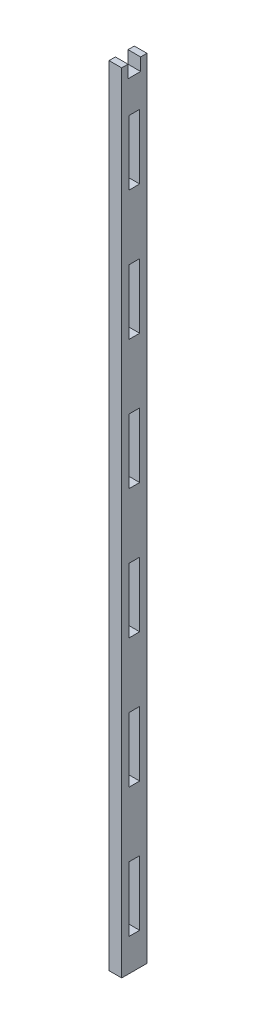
ISO-10303-21;
HEADER;
FILE_DESCRIPTION(('STEP AP214'),'2;1');
FILE_NAME('part.step','',(''),(''),'','','');
FILE_SCHEMA(('AUTOMOTIVE_DESIGN { 1 0 10303 214 1 1 1 1 }'));
ENDSEC;
DATA;
#1=APPLICATION_CONTEXT('core data for automotive mechanical design processes');
#2=APPLICATION_PROTOCOL_DEFINITION('international standard','automotive_design',2000,#1);
#3=PRODUCT_CONTEXT('',#1,'mechanical');
#4=PRODUCT('Part','Part','',(#3));
#5=PRODUCT_RELATED_PRODUCT_CATEGORY('part','',(#4));
#6=PRODUCT_DEFINITION_FORMATION('','',#4);
#7=PRODUCT_DEFINITION_CONTEXT('part definition',#1,'design');
#8=PRODUCT_DEFINITION('design','',#6,#7);
#9=PRODUCT_DEFINITION_SHAPE('','',#8);
#10=(LENGTH_UNIT() NAMED_UNIT(*) SI_UNIT(.MILLI.,.METRE.));
#11=(NAMED_UNIT(*) PLANE_ANGLE_UNIT() SI_UNIT($,.RADIAN.));
#12=(NAMED_UNIT(*) SI_UNIT($,.STERADIAN.) SOLID_ANGLE_UNIT());
#13=UNCERTAINTY_MEASURE_WITH_UNIT(LENGTH_MEASURE(1.E-05),#10,'distance_accuracy_value','');
#14=(GEOMETRIC_REPRESENTATION_CONTEXT(3) GLOBAL_UNCERTAINTY_ASSIGNED_CONTEXT((#13)) GLOBAL_UNIT_ASSIGNED_CONTEXT((#10,
#11,#12)) REPRESENTATION_CONTEXT('',''));
#15=CARTESIAN_POINT('',(0.,0.,0.));
#16=DIRECTION('',(0.,0.,1.));
#17=DIRECTION('',(1.,0.,0.));
#18=AXIS2_PLACEMENT_3D('',#15,#16,#17);
#19=CARTESIAN_POINT('',(0.,187.1265625,-1.82686513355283));
#20=DIRECTION('',(0.,1.,0.));
#21=DIRECTION('',(0.,0.,1.));
#22=AXIS2_PLACEMENT_3D('',#19,#20,#21);
#23=PLANE('',#22);
#24=DIRECTION('',(0.,0.,1.));
#25=VECTOR('',#24,1.);
#26=CARTESIAN_POINT('',(3.175,187.1265625,-1.82686513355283));
#27=LINE('',#26,#25);
#28=CARTESIAN_POINT('',(3.175,187.1265625,-4.52313486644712));
#29=VERTEX_POINT('',#28);
#30=CARTESIAN_POINT('',(3.175,187.1265625,-1.82686513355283));
#31=VERTEX_POINT('',#30);
#32=EDGE_CURVE('E485',#29,#31,#27,.T.);
#33=ORIENTED_EDGE('',*,*,#32,.T.);
#34=DIRECTION('',(1.,0.,0.));
#35=VECTOR('',#34,1.);
#36=CARTESIAN_POINT('',(0.,187.1265625,-1.82686513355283));
#37=LINE('',#36,#35);
#38=CARTESIAN_POINT('',(0.,187.1265625,-1.82686513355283));
#39=VERTEX_POINT('',#38);
#40=EDGE_CURVE('E11',#39,#31,#37,.T.);
#41=ORIENTED_EDGE('',*,*,#40,.F.);
#42=DIRECTION('',(0.,0.,1.));
#43=VECTOR('',#42,1.);
#44=CARTESIAN_POINT('',(0.,187.1265625,-1.82686513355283));
#45=LINE('',#44,#43);
#46=CARTESIAN_POINT('',(0.,187.1265625,-4.52313486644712));
#47=VERTEX_POINT('',#46);
#48=EDGE_CURVE('E489',#47,#39,#45,.T.);
#49=ORIENTED_EDGE('',*,*,#48,.F.);
#50=DIRECTION('',(1.,0.,0.));
#51=VECTOR('',#50,1.);
#52=CARTESIAN_POINT('',(0.,187.1265625,-4.52313486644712));
#53=LINE('',#52,#51);
#54=EDGE_CURVE('E494',#47,#29,#53,.T.);
#55=ORIENTED_EDGE('',*,*,#54,.T.);
#56=EDGE_LOOP('',(#33,#41,#49,#55));
#57=FACE_BOUND('',#56,.T.);
#58=ADVANCED_FACE('F38',(#57),#23,.F.);
#59=CARTESIAN_POINT('',(0.,170.8546875,-1.82686513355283));
#60=DIRECTION('',(0.,0.,1.));
#61=DIRECTION('',(1.,0.,0.));
#62=AXIS2_PLACEMENT_3D('',#59,#60,#61);
#63=PLANE('',#62);
#64=DIRECTION('',(0.,-1.,0.));
#65=VECTOR('',#64,1.);
#66=CARTESIAN_POINT('',(3.175,170.8546875,-1.82686513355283));
#67=LINE('',#66,#65);
#68=CARTESIAN_POINT('',(3.175,170.8546875,-1.82686513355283));
#69=VERTEX_POINT('',#68);
#70=EDGE_CURVE('E482',#31,#69,#67,.T.);
#71=ORIENTED_EDGE('',*,*,#70,.T.);
#72=DIRECTION('',(1.,0.,0.));
#73=VECTOR('',#72,1.);
#74=CARTESIAN_POINT('',(0.,170.8546875,-1.82686513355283));
#75=LINE('',#74,#73);
#76=CARTESIAN_POINT('',(0.,170.8546875,-1.82686513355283));
#77=VERTEX_POINT('',#76);
#78=EDGE_CURVE('E45',#77,#69,#75,.T.);
#79=ORIENTED_EDGE('',*,*,#78,.F.);
#80=DIRECTION('',(0.,-1.,0.));
#81=VECTOR('',#80,1.);
#82=CARTESIAN_POINT('',(0.,170.8546875,-1.82686513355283));
#83=LINE('',#82,#81);
#84=EDGE_CURVE('E59',#39,#77,#83,.T.);
#85=ORIENTED_EDGE('',*,*,#84,.F.);
#86=ORIENTED_EDGE('',*,*,#40,.T.);
#87=EDGE_LOOP('',(#71,#79,#85,#86));
#88=FACE_BOUND('',#87,.T.);
#89=ADVANCED_FACE('F504',(#88),#63,.F.);
#90=CARTESIAN_POINT('',(0.,170.8546875,-1.82686513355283));
#91=DIRECTION('',(0.,-1.,0.));
#92=DIRECTION('',(0.,0.,-1.));
#93=AXIS2_PLACEMENT_3D('',#90,#91,#92);
#94=PLANE('',#93);
#95=DIRECTION('',(0.,0.,-1.));
#96=VECTOR('',#95,1.);
#97=CARTESIAN_POINT('',(3.175,170.8546875,-1.82686513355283));
#98=LINE('',#97,#96);
#99=CARTESIAN_POINT('',(3.175,170.8546875,-4.52313486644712));
#100=VERTEX_POINT('',#99);
#101=EDGE_CURVE('E479',#69,#100,#98,.T.);
#102=ORIENTED_EDGE('',*,*,#101,.T.);
#103=DIRECTION('',(1.,0.,0.));
#104=VECTOR('',#103,1.);
#105=CARTESIAN_POINT('',(0.,170.8546875,-4.52313486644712));
#106=LINE('',#105,#104);
#107=CARTESIAN_POINT('',(0.,170.8546875,-4.52313486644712));
#108=VERTEX_POINT('',#107);
#109=EDGE_CURVE('E497',#108,#100,#106,.T.);
#110=ORIENTED_EDGE('',*,*,#109,.F.);
#111=DIRECTION('',(0.,0.,-1.));
#112=VECTOR('',#111,1.);
#113=CARTESIAN_POINT('',(0.,170.8546875,-1.82686513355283));
#114=LINE('',#113,#112);
#115=EDGE_CURVE('E492',#77,#108,#114,.T.);
#116=ORIENTED_EDGE('',*,*,#115,.F.);
#117=ORIENTED_EDGE('',*,*,#78,.T.);
#118=EDGE_LOOP('',(#102,#110,#116,#117));
#119=FACE_BOUND('',#118,.T.);
#120=ADVANCED_FACE('F501',(#119),#94,.F.);
#121=CARTESIAN_POINT('',(0.,170.8546875,-4.52313486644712));
#122=DIRECTION('',(0.,0.,-1.));
#123=DIRECTION('',(-1.,0.,0.));
#124=AXIS2_PLACEMENT_3D('',#121,#122,#123);
#125=PLANE('',#124);
#126=DIRECTION('',(0.,1.,0.));
#127=VECTOR('',#126,1.);
#128=CARTESIAN_POINT('',(3.175,170.8546875,-4.52313486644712));
#129=LINE('',#128,#127);
#130=EDGE_CURVE('E477',#100,#29,#129,.T.);
#131=ORIENTED_EDGE('',*,*,#130,.T.);
#132=ORIENTED_EDGE('',*,*,#54,.F.);
#133=DIRECTION('',(0.,1.,0.));
#134=VECTOR('',#133,1.);
#135=CARTESIAN_POINT('',(0.,170.8546875,-4.52313486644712));
#136=LINE('',#135,#134);
#137=EDGE_CURVE('E52',#108,#47,#136,.T.);
#138=ORIENTED_EDGE('',*,*,#137,.F.);
#139=ORIENTED_EDGE('',*,*,#109,.T.);
#140=EDGE_LOOP('',(#131,#132,#138,#139));
#141=FACE_BOUND('',#140,.T.);
#142=ADVANCED_FACE('F510',(#141),#125,.F.);
#143=CARTESIAN_POINT('',(0.,154.5828125,-1.82686513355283));
#144=DIRECTION('',(0.,1.,0.));
#145=DIRECTION('',(0.,0.,1.));
#146=AXIS2_PLACEMENT_3D('',#143,#144,#145);
#147=PLANE('',#146);
#148=DIRECTION('',(0.,0.,1.));
#149=VECTOR('',#148,1.);
#150=CARTESIAN_POINT('',(3.175,154.5828125,-1.82686513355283));
#151=LINE('',#150,#149);
#152=CARTESIAN_POINT('',(3.175,154.5828125,-4.52313486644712));
#153=VERTEX_POINT('',#152);
#154=CARTESIAN_POINT('',(3.175,154.5828125,-1.82686513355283));
#155=VERTEX_POINT('',#154);
#156=EDGE_CURVE('E453',#153,#155,#151,.T.);
#157=ORIENTED_EDGE('',*,*,#156,.T.);
#158=DIRECTION('',(1.,0.,0.));
#159=VECTOR('',#158,1.);
#160=CARTESIAN_POINT('',(0.,154.5828125,-1.82686513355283));
#161=LINE('',#160,#159);
#162=CARTESIAN_POINT('',(0.,154.5828125,-1.82686513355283));
#163=VERTEX_POINT('',#162);
#164=EDGE_CURVE('E474',#163,#155,#161,.T.);
#165=ORIENTED_EDGE('',*,*,#164,.F.);
#166=DIRECTION('',(0.,0.,1.));
#167=VECTOR('',#166,1.);
#168=CARTESIAN_POINT('',(0.,154.5828125,-1.82686513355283));
#169=LINE('',#168,#167);
#170=CARTESIAN_POINT('',(0.,154.5828125,-4.52313486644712));
#171=VERTEX_POINT('',#170);
#172=EDGE_CURVE('E458',#171,#163,#169,.T.);
#173=ORIENTED_EDGE('',*,*,#172,.F.);
#174=DIRECTION('',(1.,0.,0.));
#175=VECTOR('',#174,1.);
#176=CARTESIAN_POINT('',(0.,154.5828125,-4.52313486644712));
#177=LINE('',#176,#175);
#178=EDGE_CURVE('E465',#171,#153,#177,.T.);
#179=ORIENTED_EDGE('',*,*,#178,.T.);
#180=EDGE_LOOP('',(#157,#165,#173,#179));
#181=FACE_BOUND('',#180,.T.);
#182=ADVANCED_FACE('F512',(#181),#147,.F.);
#183=CARTESIAN_POINT('',(0.,138.3109375,-1.82686513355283));
#184=DIRECTION('',(0.,0.,1.));
#185=DIRECTION('',(1.,0.,0.));
#186=AXIS2_PLACEMENT_3D('',#183,#184,#185);
#187=PLANE('',#186);
#188=DIRECTION('',(0.,-1.,0.));
#189=VECTOR('',#188,1.);
#190=CARTESIAN_POINT('',(3.175,138.3109375,-1.82686513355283));
#191=LINE('',#190,#189);
#192=CARTESIAN_POINT('',(3.175,138.3109375,-1.82686513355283));
#193=VERTEX_POINT('',#192);
#194=EDGE_CURVE('E450',#155,#193,#191,.T.);
#195=ORIENTED_EDGE('',*,*,#194,.T.);
#196=DIRECTION('',(1.,0.,0.));
#197=VECTOR('',#196,1.);
#198=CARTESIAN_POINT('',(0.,138.3109375,-1.82686513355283));
#199=LINE('',#198,#197);
#200=CARTESIAN_POINT('',(0.,138.3109375,-1.82686513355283));
#201=VERTEX_POINT('',#200);
#202=EDGE_CURVE('E471',#201,#193,#199,.T.);
#203=ORIENTED_EDGE('',*,*,#202,.F.);
#204=DIRECTION('',(0.,-1.,0.));
#205=VECTOR('',#204,1.);
#206=CARTESIAN_POINT('',(0.,138.3109375,-1.82686513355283));
#207=LINE('',#206,#205);
#208=EDGE_CURVE('E460',#163,#201,#207,.T.);
#209=ORIENTED_EDGE('',*,*,#208,.F.);
#210=ORIENTED_EDGE('',*,*,#164,.T.);
#211=EDGE_LOOP('',(#195,#203,#209,#210));
#212=FACE_BOUND('',#211,.T.);
#213=ADVANCED_FACE('F518',(#212),#187,.F.);
#214=CARTESIAN_POINT('',(0.,138.3109375,-1.82686513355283));
#215=DIRECTION('',(0.,-1.,0.));
#216=DIRECTION('',(0.,0.,-1.));
#217=AXIS2_PLACEMENT_3D('',#214,#215,#216);
#218=PLANE('',#217);
#219=DIRECTION('',(0.,0.,-1.));
#220=VECTOR('',#219,1.);
#221=CARTESIAN_POINT('',(3.175,138.3109375,-1.82686513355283));
#222=LINE('',#221,#220);
#223=CARTESIAN_POINT('',(3.175,138.3109375,-4.52313486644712));
#224=VERTEX_POINT('',#223);
#225=EDGE_CURVE('E447',#193,#224,#222,.T.);
#226=ORIENTED_EDGE('',*,*,#225,.T.);
#227=DIRECTION('',(1.,0.,0.));
#228=VECTOR('',#227,1.);
#229=CARTESIAN_POINT('',(0.,138.3109375,-4.52313486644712));
#230=LINE('',#229,#228);
#231=CARTESIAN_POINT('',(0.,138.3109375,-4.52313486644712));
#232=VERTEX_POINT('',#231);
#233=EDGE_CURVE('E468',#232,#224,#230,.T.);
#234=ORIENTED_EDGE('',*,*,#233,.F.);
#235=DIRECTION('',(0.,0.,-1.));
#236=VECTOR('',#235,1.);
#237=CARTESIAN_POINT('',(0.,138.3109375,-1.82686513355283));
#238=LINE('',#237,#236);
#239=EDGE_CURVE('E462',#201,#232,#238,.T.);
#240=ORIENTED_EDGE('',*,*,#239,.F.);
#241=ORIENTED_EDGE('',*,*,#202,.T.);
#242=EDGE_LOOP('',(#226,#234,#240,#241));
#243=FACE_BOUND('',#242,.T.);
#244=ADVANCED_FACE('F551',(#243),#218,.F.);
#245=CARTESIAN_POINT('',(0.,138.3109375,-4.52313486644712));
#246=DIRECTION('',(0.,0.,-1.));
#247=DIRECTION('',(-1.,0.,0.));
#248=AXIS2_PLACEMENT_3D('',#245,#246,#247);
#249=PLANE('',#248);
#250=DIRECTION('',(0.,1.,0.));
#251=VECTOR('',#250,1.);
#252=CARTESIAN_POINT('',(3.175,138.3109375,-4.52313486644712));
#253=LINE('',#252,#251);
#254=EDGE_CURVE('E445',#224,#153,#253,.T.);
#255=ORIENTED_EDGE('',*,*,#254,.T.);
#256=ORIENTED_EDGE('',*,*,#178,.F.);
#257=DIRECTION('',(0.,1.,0.));
#258=VECTOR('',#257,1.);
#259=CARTESIAN_POINT('',(0.,138.3109375,-4.52313486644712));
#260=LINE('',#259,#258);
#261=EDGE_CURVE('E456',#232,#171,#260,.T.);
#262=ORIENTED_EDGE('',*,*,#261,.F.);
#263=ORIENTED_EDGE('',*,*,#233,.T.);
#264=EDGE_LOOP('',(#255,#256,#262,#263));
#265=FACE_BOUND('',#264,.T.);
#266=ADVANCED_FACE('F561',(#265),#249,.F.);
#267=CARTESIAN_POINT('',(0.,122.0390625,-1.82686513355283));
#268=DIRECTION('',(0.,1.,0.));
#269=DIRECTION('',(0.,0.,1.));
#270=AXIS2_PLACEMENT_3D('',#267,#268,#269);
#271=PLANE('',#270);
#272=DIRECTION('',(0.,0.,1.));
#273=VECTOR('',#272,1.);
#274=CARTESIAN_POINT('',(3.175,122.0390625,-1.82686513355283));
#275=LINE('',#274,#273);
#276=CARTESIAN_POINT('',(3.175,122.0390625,-4.52313486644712));
#277=VERTEX_POINT('',#276);
#278=CARTESIAN_POINT('',(3.175,122.0390625,-1.82686513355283));
#279=VERTEX_POINT('',#278);
#280=EDGE_CURVE('E421',#277,#279,#275,.T.);
#281=ORIENTED_EDGE('',*,*,#280,.T.);
#282=DIRECTION('',(1.,0.,0.));
#283=VECTOR('',#282,1.);
#284=CARTESIAN_POINT('',(0.,122.0390625,-1.82686513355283));
#285=LINE('',#284,#283);
#286=CARTESIAN_POINT('',(0.,122.0390625,-1.82686513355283));
#287=VERTEX_POINT('',#286);
#288=EDGE_CURVE('E442',#287,#279,#285,.T.);
#289=ORIENTED_EDGE('',*,*,#288,.F.);
#290=DIRECTION('',(0.,0.,1.));
#291=VECTOR('',#290,1.);
#292=CARTESIAN_POINT('',(0.,122.0390625,-1.82686513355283));
#293=LINE('',#292,#291);
#294=CARTESIAN_POINT('',(0.,122.0390625,-4.52313486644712));
#295=VERTEX_POINT('',#294);
#296=EDGE_CURVE('E426',#295,#287,#293,.T.);
#297=ORIENTED_EDGE('',*,*,#296,.F.);
#298=DIRECTION('',(1.,0.,0.));
#299=VECTOR('',#298,1.);
#300=CARTESIAN_POINT('',(0.,122.0390625,-4.52313486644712));
#301=LINE('',#300,#299);
#302=EDGE_CURVE('E433',#295,#277,#301,.T.);
#303=ORIENTED_EDGE('',*,*,#302,.T.);
#304=EDGE_LOOP('',(#281,#289,#297,#303));
#305=FACE_BOUND('',#304,.T.);
#306=ADVANCED_FACE('F571',(#305),#271,.F.);
#307=CARTESIAN_POINT('',(0.,105.7671875,-1.82686513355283));
#308=DIRECTION('',(0.,0.,1.));
#309=DIRECTION('',(1.,0.,0.));
#310=AXIS2_PLACEMENT_3D('',#307,#308,#309);
#311=PLANE('',#310);
#312=DIRECTION('',(0.,-1.,0.));
#313=VECTOR('',#312,1.);
#314=CARTESIAN_POINT('',(3.175,105.7671875,-1.82686513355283));
#315=LINE('',#314,#313);
#316=CARTESIAN_POINT('',(3.175,105.7671875,-1.82686513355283));
#317=VERTEX_POINT('',#316);
#318=EDGE_CURVE('E418',#279,#317,#315,.T.);
#319=ORIENTED_EDGE('',*,*,#318,.T.);
#320=DIRECTION('',(1.,0.,0.));
#321=VECTOR('',#320,1.);
#322=CARTESIAN_POINT('',(0.,105.7671875,-1.82686513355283));
#323=LINE('',#322,#321);
#324=CARTESIAN_POINT('',(0.,105.7671875,-1.82686513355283));
#325=VERTEX_POINT('',#324);
#326=EDGE_CURVE('E439',#325,#317,#323,.T.);
#327=ORIENTED_EDGE('',*,*,#326,.F.);
#328=DIRECTION('',(0.,-1.,0.));
#329=VECTOR('',#328,1.);
#330=CARTESIAN_POINT('',(0.,105.7671875,-1.82686513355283));
#331=LINE('',#330,#329);
#332=EDGE_CURVE('E428',#287,#325,#331,.T.);
#333=ORIENTED_EDGE('',*,*,#332,.F.);
#334=ORIENTED_EDGE('',*,*,#288,.T.);
#335=EDGE_LOOP('',(#319,#327,#333,#334));
#336=FACE_BOUND('',#335,.T.);
#337=ADVANCED_FACE('F581',(#336),#311,.F.);
#338=CARTESIAN_POINT('',(0.,105.7671875,-1.82686513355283));
#339=DIRECTION('',(0.,-1.,0.));
#340=DIRECTION('',(0.,0.,-1.));
#341=AXIS2_PLACEMENT_3D('',#338,#339,#340);
#342=PLANE('',#341);
#343=DIRECTION('',(0.,0.,-1.));
#344=VECTOR('',#343,1.);
#345=CARTESIAN_POINT('',(3.175,105.7671875,-1.82686513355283));
#346=LINE('',#345,#344);
#347=CARTESIAN_POINT('',(3.175,105.7671875,-4.52313486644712));
#348=VERTEX_POINT('',#347);
#349=EDGE_CURVE('E415',#317,#348,#346,.T.);
#350=ORIENTED_EDGE('',*,*,#349,.T.);
#351=DIRECTION('',(1.,0.,0.));
#352=VECTOR('',#351,1.);
#353=CARTESIAN_POINT('',(0.,105.7671875,-4.52313486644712));
#354=LINE('',#353,#352);
#355=CARTESIAN_POINT('',(0.,105.7671875,-4.52313486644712));
#356=VERTEX_POINT('',#355);
#357=EDGE_CURVE('E436',#356,#348,#354,.T.);
#358=ORIENTED_EDGE('',*,*,#357,.F.);
#359=DIRECTION('',(0.,0.,-1.));
#360=VECTOR('',#359,1.);
#361=CARTESIAN_POINT('',(0.,105.7671875,-1.82686513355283));
#362=LINE('',#361,#360);
#363=EDGE_CURVE('E430',#325,#356,#362,.T.);
#364=ORIENTED_EDGE('',*,*,#363,.F.);
#365=ORIENTED_EDGE('',*,*,#326,.T.);
#366=EDGE_LOOP('',(#350,#358,#364,#365));
#367=FACE_BOUND('',#366,.T.);
#368=ADVANCED_FACE('F591',(#367),#342,.F.);
#369=CARTESIAN_POINT('',(0.,105.7671875,-4.52313486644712));
#370=DIRECTION('',(0.,0.,-1.));
#371=DIRECTION('',(-1.,0.,0.));
#372=AXIS2_PLACEMENT_3D('',#369,#370,#371);
#373=PLANE('',#372);
#374=DIRECTION('',(0.,1.,0.));
#375=VECTOR('',#374,1.);
#376=CARTESIAN_POINT('',(3.175,105.7671875,-4.52313486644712));
#377=LINE('',#376,#375);
#378=EDGE_CURVE('E413',#348,#277,#377,.T.);
#379=ORIENTED_EDGE('',*,*,#378,.T.);
#380=ORIENTED_EDGE('',*,*,#302,.F.);
#381=DIRECTION('',(0.,1.,0.));
#382=VECTOR('',#381,1.);
#383=CARTESIAN_POINT('',(0.,105.7671875,-4.52313486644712));
#384=LINE('',#383,#382);
#385=EDGE_CURVE('E424',#356,#295,#384,.T.);
#386=ORIENTED_EDGE('',*,*,#385,.F.);
#387=ORIENTED_EDGE('',*,*,#357,.T.);
#388=EDGE_LOOP('',(#379,#380,#386,#387));
#389=FACE_BOUND('',#388,.T.);
#390=ADVANCED_FACE('F601',(#389),#373,.F.);
#391=CARTESIAN_POINT('',(0.,89.4953125,-1.82686513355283));
#392=DIRECTION('',(0.,1.,0.));
#393=DIRECTION('',(0.,0.,1.));
#394=AXIS2_PLACEMENT_3D('',#391,#392,#393);
#395=PLANE('',#394);
#396=DIRECTION('',(0.,0.,1.));
#397=VECTOR('',#396,1.);
#398=CARTESIAN_POINT('',(3.175,89.4953125,-1.82686513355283));
#399=LINE('',#398,#397);
#400=CARTESIAN_POINT('',(3.175,89.4953125,-4.52313486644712));
#401=VERTEX_POINT('',#400);
#402=CARTESIAN_POINT('',(3.175,89.4953125,-1.82686513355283));
#403=VERTEX_POINT('',#402);
#404=EDGE_CURVE('E389',#401,#403,#399,.T.);
#405=ORIENTED_EDGE('',*,*,#404,.T.);
#406=DIRECTION('',(1.,0.,0.));
#407=VECTOR('',#406,1.);
#408=CARTESIAN_POINT('',(0.,89.4953125,-1.82686513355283));
#409=LINE('',#408,#407);
#410=CARTESIAN_POINT('',(0.,89.4953125,-1.82686513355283));
#411=VERTEX_POINT('',#410);
#412=EDGE_CURVE('E410',#411,#403,#409,.T.);
#413=ORIENTED_EDGE('',*,*,#412,.F.);
#414=DIRECTION('',(0.,0.,1.));
#415=VECTOR('',#414,1.);
#416=CARTESIAN_POINT('',(0.,89.4953125,-1.82686513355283));
#417=LINE('',#416,#415);
#418=CARTESIAN_POINT('',(0.,89.4953125,-4.52313486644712));
#419=VERTEX_POINT('',#418);
#420=EDGE_CURVE('E394',#419,#411,#417,.T.);
#421=ORIENTED_EDGE('',*,*,#420,.F.);
#422=DIRECTION('',(1.,0.,0.));
#423=VECTOR('',#422,1.);
#424=CARTESIAN_POINT('',(0.,89.4953125,-4.52313486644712));
#425=LINE('',#424,#423);
#426=EDGE_CURVE('E401',#419,#401,#425,.T.);
#427=ORIENTED_EDGE('',*,*,#426,.T.);
#428=EDGE_LOOP('',(#405,#413,#421,#427));
#429=FACE_BOUND('',#428,.T.);
#430=ADVANCED_FACE('F611',(#429),#395,.F.);
#431=CARTESIAN_POINT('',(0.,73.2234375,-1.82686513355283));
#432=DIRECTION('',(0.,0.,1.));
#433=DIRECTION('',(1.,0.,0.));
#434=AXIS2_PLACEMENT_3D('',#431,#432,#433);
#435=PLANE('',#434);
#436=DIRECTION('',(0.,-1.,0.));
#437=VECTOR('',#436,1.);
#438=CARTESIAN_POINT('',(3.175,73.2234375,-1.82686513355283));
#439=LINE('',#438,#437);
#440=CARTESIAN_POINT('',(3.175,73.2234375,-1.82686513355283));
#441=VERTEX_POINT('',#440);
#442=EDGE_CURVE('E386',#403,#441,#439,.T.);
#443=ORIENTED_EDGE('',*,*,#442,.T.);
#444=DIRECTION('',(1.,0.,0.));
#445=VECTOR('',#444,1.);
#446=CARTESIAN_POINT('',(0.,73.2234375,-1.82686513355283));
#447=LINE('',#446,#445);
#448=CARTESIAN_POINT('',(0.,73.2234375,-1.82686513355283));
#449=VERTEX_POINT('',#448);
#450=EDGE_CURVE('E407',#449,#441,#447,.T.);
#451=ORIENTED_EDGE('',*,*,#450,.F.);
#452=DIRECTION('',(0.,-1.,0.));
#453=VECTOR('',#452,1.);
#454=CARTESIAN_POINT('',(0.,73.2234375,-1.82686513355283));
#455=LINE('',#454,#453);
#456=EDGE_CURVE('E396',#411,#449,#455,.T.);
#457=ORIENTED_EDGE('',*,*,#456,.F.);
#458=ORIENTED_EDGE('',*,*,#412,.T.);
#459=EDGE_LOOP('',(#443,#451,#457,#458));
#460=FACE_BOUND('',#459,.T.);
#461=ADVANCED_FACE('F621',(#460),#435,.F.);
#462=CARTESIAN_POINT('',(0.,73.2234375,-1.82686513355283));
#463=DIRECTION('',(0.,-1.,0.));
#464=DIRECTION('',(0.,0.,-1.));
#465=AXIS2_PLACEMENT_3D('',#462,#463,#464);
#466=PLANE('',#465);
#467=DIRECTION('',(0.,0.,-1.));
#468=VECTOR('',#467,1.);
#469=CARTESIAN_POINT('',(3.175,73.2234375,-1.82686513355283));
#470=LINE('',#469,#468);
#471=CARTESIAN_POINT('',(3.175,73.2234375,-4.52313486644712));
#472=VERTEX_POINT('',#471);
#473=EDGE_CURVE('E383',#441,#472,#470,.T.);
#474=ORIENTED_EDGE('',*,*,#473,.T.);
#475=DIRECTION('',(1.,0.,0.));
#476=VECTOR('',#475,1.);
#477=CARTESIAN_POINT('',(0.,73.2234375,-4.52313486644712));
#478=LINE('',#477,#476);
#479=CARTESIAN_POINT('',(0.,73.2234375,-4.52313486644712));
#480=VERTEX_POINT('',#479);
#481=EDGE_CURVE('E404',#480,#472,#478,.T.);
#482=ORIENTED_EDGE('',*,*,#481,.F.);
#483=DIRECTION('',(0.,0.,-1.));
#484=VECTOR('',#483,1.);
#485=CARTESIAN_POINT('',(0.,73.2234375,-1.82686513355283));
#486=LINE('',#485,#484);
#487=EDGE_CURVE('E398',#449,#480,#486,.T.);
#488=ORIENTED_EDGE('',*,*,#487,.F.);
#489=ORIENTED_EDGE('',*,*,#450,.T.);
#490=EDGE_LOOP('',(#474,#482,#488,#489));
#491=FACE_BOUND('',#490,.T.);
#492=ADVANCED_FACE('F631',(#491),#466,.F.);
#493=CARTESIAN_POINT('',(0.,73.2234375,-4.52313486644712));
#494=DIRECTION('',(0.,0.,-1.));
#495=DIRECTION('',(-1.,0.,0.));
#496=AXIS2_PLACEMENT_3D('',#493,#494,#495);
#497=PLANE('',#496);
#498=DIRECTION('',(0.,1.,0.));
#499=VECTOR('',#498,1.);
#500=CARTESIAN_POINT('',(3.175,73.2234375,-4.52313486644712));
#501=LINE('',#500,#499);
#502=EDGE_CURVE('E381',#472,#401,#501,.T.);
#503=ORIENTED_EDGE('',*,*,#502,.T.);
#504=ORIENTED_EDGE('',*,*,#426,.F.);
#505=DIRECTION('',(0.,1.,0.));
#506=VECTOR('',#505,1.);
#507=CARTESIAN_POINT('',(0.,73.2234375,-4.52313486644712));
#508=LINE('',#507,#506);
#509=EDGE_CURVE('E392',#480,#419,#508,.T.);
#510=ORIENTED_EDGE('',*,*,#509,.F.);
#511=ORIENTED_EDGE('',*,*,#481,.T.);
#512=EDGE_LOOP('',(#503,#504,#510,#511));
#513=FACE_BOUND('',#512,.T.);
#514=ADVANCED_FACE('F641',(#513),#497,.F.);
#515=CARTESIAN_POINT('',(3.175,198.4375,0.));
#516=DIRECTION('',(0.,-1.,0.));
#517=DIRECTION('',(0.,0.,-1.));
#518=AXIS2_PLACEMENT_3D('',#515,#516,#517);
#519=PLANE('',#518);
#520=DIRECTION('',(0.,0.,1.));
#521=VECTOR('',#520,1.);
#522=CARTESIAN_POINT('',(0.,198.4375,0.));
#523=LINE('',#522,#521);
#524=CARTESIAN_POINT('',(0.,198.4375,-6.35));
#525=VERTEX_POINT('',#524);
#526=CARTESIAN_POINT('',(0.,198.4375,-4.76249999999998));
#527=VERTEX_POINT('',#526);
#528=EDGE_CURVE('E350',#525,#527,#523,.T.);
#529=ORIENTED_EDGE('',*,*,#528,.T.);
#530=DIRECTION('',(1.,0.,0.));
#531=VECTOR('',#530,1.);
#532=CARTESIAN_POINT('',(3.175,198.4375,-4.76249999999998));
#533=LINE('',#532,#531);
#534=CARTESIAN_POINT('',(3.175,198.4375,-4.76249999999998));
#535=VERTEX_POINT('',#534);
#536=EDGE_CURVE('E342',#527,#535,#533,.T.);
#537=ORIENTED_EDGE('',*,*,#536,.T.);
#538=DIRECTION('',(0.,0.,1.));
#539=VECTOR('',#538,1.);
#540=CARTESIAN_POINT('',(3.175,198.4375,0.));
#541=LINE('',#540,#539);
#542=CARTESIAN_POINT('',(3.175,198.4375,-6.35));
#543=VERTEX_POINT('',#542);
#544=EDGE_CURVE('E355',#543,#535,#541,.T.);
#545=ORIENTED_EDGE('',*,*,#544,.F.);
#546=DIRECTION('',(-1.,0.,0.));
#547=VECTOR('',#546,1.);
#548=CARTESIAN_POINT('',(3.175,198.4375,-6.35));
#549=LINE('',#548,#547);
#550=EDGE_CURVE('E370',#543,#525,#549,.T.);
#551=ORIENTED_EDGE('',*,*,#550,.T.);
#552=EDGE_LOOP('',(#529,#537,#545,#551));
#553=FACE_BOUND('',#552,.T.);
#554=ADVANCED_FACE('F651',(#553),#519,.F.);
#555=CARTESIAN_POINT('',(3.175,0.,0.));
#556=DIRECTION('',(0.,0.,-1.));
#557=DIRECTION('',(-1.,0.,0.));
#558=AXIS2_PLACEMENT_3D('',#555,#556,#557);
#559=PLANE('',#558);
#560=DIRECTION('',(0.,-1.,0.));
#561=VECTOR('',#560,1.);
#562=CARTESIAN_POINT('',(0.,0.,0.));
#563=LINE('',#562,#561);
#564=CARTESIAN_POINT('',(0.,198.4375,0.));
#565=VERTEX_POINT('',#564);
#566=CARTESIAN_POINT('',(0.,0.,0.));
#567=VERTEX_POINT('',#566);
#568=EDGE_CURVE('E345',#565,#567,#563,.T.);
#569=ORIENTED_EDGE('',*,*,#568,.T.);
#570=DIRECTION('',(-1.,0.,0.));
#571=VECTOR('',#570,1.);
#572=CARTESIAN_POINT('',(3.175,0.,0.));
#573=LINE('',#572,#571);
#574=CARTESIAN_POINT('',(3.175,0.,0.));
#575=VERTEX_POINT('',#574);
#576=EDGE_CURVE('E376',#575,#567,#573,.T.);
#577=ORIENTED_EDGE('',*,*,#576,.F.);
#578=DIRECTION('',(0.,-1.,0.));
#579=VECTOR('',#578,1.);
#580=CARTESIAN_POINT('',(3.175,0.,0.));
#581=LINE('',#580,#579);
#582=CARTESIAN_POINT('',(3.175,198.4375,0.));
#583=VERTEX_POINT('',#582);
#584=EDGE_CURVE('E346',#583,#575,#581,.T.);
#585=ORIENTED_EDGE('',*,*,#584,.F.);
#586=DIRECTION('',(-1.,0.,0.));
#587=VECTOR('',#586,1.);
#588=CARTESIAN_POINT('',(3.175,198.4375,0.));
#589=LINE('',#588,#587);
#590=EDGE_CURVE('E358',#583,#565,#589,.T.);
#591=ORIENTED_EDGE('',*,*,#590,.T.);
#592=EDGE_LOOP('',(#569,#577,#585,#591));
#593=FACE_BOUND('',#592,.T.);
#594=ADVANCED_FACE('F753',(#593),#559,.F.);
#595=CARTESIAN_POINT('',(3.175,0.,0.));
#596=DIRECTION('',(0.,1.,0.));
#597=DIRECTION('',(0.,0.,1.));
#598=AXIS2_PLACEMENT_3D('',#595,#596,#597);
#599=PLANE('',#598);
#600=DIRECTION('',(0.,0.,-1.));
#601=VECTOR('',#600,1.);
#602=CARTESIAN_POINT('',(0.,0.,0.));
#603=LINE('',#602,#601);
#604=CARTESIAN_POINT('',(0.,0.,-6.35));
#605=VERTEX_POINT('',#604);
#606=EDGE_CURVE('E361',#567,#605,#603,.T.);
#607=ORIENTED_EDGE('',*,*,#606,.T.);
#608=DIRECTION('',(-1.,0.,0.));
#609=VECTOR('',#608,1.);
#610=CARTESIAN_POINT('',(3.175,0.,-6.35));
#611=LINE('',#610,#609);
#612=CARTESIAN_POINT('',(3.175,0.,-6.35));
#613=VERTEX_POINT('',#612);
#614=EDGE_CURVE('E373',#613,#605,#611,.T.);
#615=ORIENTED_EDGE('',*,*,#614,.F.);
#616=DIRECTION('',(0.,0.,-1.));
#617=VECTOR('',#616,1.);
#618=CARTESIAN_POINT('',(3.175,0.,0.));
#619=LINE('',#618,#617);
#620=EDGE_CURVE('E349',#575,#613,#619,.T.);
#621=ORIENTED_EDGE('',*,*,#620,.F.);
#622=ORIENTED_EDGE('',*,*,#576,.T.);
#623=EDGE_LOOP('',(#607,#615,#621,#622));
#624=FACE_BOUND('',#623,.T.);
#625=ADVANCED_FACE('F749',(#624),#599,.F.);
#626=CARTESIAN_POINT('',(3.175,0.,-6.35));
#627=DIRECTION('',(0.,0.,1.));
#628=DIRECTION('',(0.,-1.,0.));
#629=AXIS2_PLACEMENT_3D('',#626,#627,#628);
#630=PLANE('',#629);
#631=DIRECTION('',(0.,1.,0.));
#632=VECTOR('',#631,1.);
#633=CARTESIAN_POINT('',(0.,0.,-6.35));
#634=LINE('',#633,#632);
#635=EDGE_CURVE('E363',#605,#525,#634,.T.);
#636=ORIENTED_EDGE('',*,*,#635,.T.);
#637=ORIENTED_EDGE('',*,*,#550,.F.);
#638=DIRECTION('',(0.,1.,0.));
#639=VECTOR('',#638,1.);
#640=CARTESIAN_POINT('',(3.175,0.,-6.35));
#641=LINE('',#640,#639);
#642=EDGE_CURVE('E352',#613,#543,#641,.T.);
#643=ORIENTED_EDGE('',*,*,#642,.F.);
#644=ORIENTED_EDGE('',*,*,#614,.T.);
#645=EDGE_LOOP('',(#636,#637,#643,#644));
#646=FACE_BOUND('',#645,.T.);
#647=ADVANCED_FACE('F745',(#646),#630,.F.);
#648=CARTESIAN_POINT('',(3.175,198.4375,-1.58749999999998));
#649=VERTEX_POINT('',#648);
#650=EDGE_CURVE('E354',#649,#583,#541,.T.);
#651=ORIENTED_EDGE('',*,*,#650,.F.);
#652=DIRECTION('',(-1.,0.,0.));
#653=VECTOR('',#652,1.);
#654=CARTESIAN_POINT('',(3.175,198.4375,-1.58749999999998));
#655=LINE('',#654,#653);
#656=CARTESIAN_POINT('',(0.,198.4375,-1.58749999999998));
#657=VERTEX_POINT('',#656);
#658=EDGE_CURVE('E337',#649,#657,#655,.T.);
#659=ORIENTED_EDGE('',*,*,#658,.T.);
#660=EDGE_CURVE('E365',#657,#565,#523,.T.);
#661=ORIENTED_EDGE('',*,*,#660,.T.);
#662=ORIENTED_EDGE('',*,*,#590,.F.);
#663=EDGE_LOOP('',(#651,#659,#661,#662));
#664=FACE_BOUND('',#663,.T.);
#665=ADVANCED_FACE('F664',(#664),#519,.F.);
#666=CARTESIAN_POINT('',(3.175,0.,0.));
#667=DIRECTION('',(-1.,0.,0.));
#668=DIRECTION('',(0.,0.,1.));
#669=AXIS2_PLACEMENT_3D('',#666,#667,#668);
#670=PLANE('',#669);
#671=DIRECTION('',(0.,0.,1.));
#672=VECTOR('',#671,1.);
#673=CARTESIAN_POINT('',(3.175,56.9515625,-1.82686513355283));
#674=LINE('',#673,#672);
#675=CARTESIAN_POINT('',(3.175,56.9515625,-4.52313486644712));
#676=VERTEX_POINT('',#675);
#677=CARTESIAN_POINT('',(3.175,56.9515625,-1.82686513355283));
#678=VERTEX_POINT('',#677);
#679=EDGE_CURVE('E248',#676,#678,#674,.T.);
#680=ORIENTED_EDGE('',*,*,#679,.F.);
#681=DIRECTION('',(0.,1.,0.));
#682=VECTOR('',#681,1.);
#683=CARTESIAN_POINT('',(3.175,40.6796875,-4.52313486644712));
#684=LINE('',#683,#682);
#685=CARTESIAN_POINT('',(3.175,40.6796875,-4.52313486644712));
#686=VERTEX_POINT('',#685);
#687=EDGE_CURVE('E284',#686,#676,#684,.T.);
#688=ORIENTED_EDGE('',*,*,#687,.F.);
#689=DIRECTION('',(0.,0.,-1.));
#690=VECTOR('',#689,1.);
#691=CARTESIAN_POINT('',(3.175,40.6796875,-1.82686513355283));
#692=LINE('',#691,#690);
#693=CARTESIAN_POINT('',(3.175,40.6796875,-1.82686513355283));
#694=VERTEX_POINT('',#693);
#695=EDGE_CURVE('E270',#694,#686,#692,.T.);
#696=ORIENTED_EDGE('',*,*,#695,.F.);
#697=DIRECTION('',(0.,-1.,0.));
#698=VECTOR('',#697,1.);
#699=CARTESIAN_POINT('',(3.175,40.6796875,-1.82686513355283));
#700=LINE('',#699,#698);
#701=EDGE_CURVE('E262',#678,#694,#700,.T.);
#702=ORIENTED_EDGE('',*,*,#701,.F.);
#703=EDGE_LOOP('',(#680,#688,#696,#702));
#704=FACE_BOUND('',#703,.T.);
#705=DIRECTION('',(0.,0.,1.));
#706=VECTOR('',#705,1.);
#707=CARTESIAN_POINT('',(3.175,24.4078125,-1.82686513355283));
#708=LINE('',#707,#706);
#709=CARTESIAN_POINT('',(3.175,24.4078125,-4.52313486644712));
#710=VERTEX_POINT('',#709);
#711=CARTESIAN_POINT('',(3.175,24.4078125,-1.82686513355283));
#712=VERTEX_POINT('',#711);
#713=EDGE_CURVE('E305',#710,#712,#708,.T.);
#714=ORIENTED_EDGE('',*,*,#713,.F.);
#715=DIRECTION('',(0.,1.,0.));
#716=VECTOR('',#715,1.);
#717=CARTESIAN_POINT('',(3.175,8.1359375,-4.52313486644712));
#718=LINE('',#717,#716);
#719=CARTESIAN_POINT('',(3.175,8.1359375,-4.52313486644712));
#720=VERTEX_POINT('',#719);
#721=EDGE_CURVE('E289',#720,#710,#718,.T.);
#722=ORIENTED_EDGE('',*,*,#721,.F.);
#723=DIRECTION('',(0.,0.,-1.));
#724=VECTOR('',#723,1.);
#725=CARTESIAN_POINT('',(3.175,8.1359375,-1.82686513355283));
#726=LINE('',#725,#724);
#727=CARTESIAN_POINT('',(3.175,8.1359375,-1.82686513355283));
#728=VERTEX_POINT('',#727);
#729=EDGE_CURVE('E294',#728,#720,#726,.T.);
#730=ORIENTED_EDGE('',*,*,#729,.F.);
#731=DIRECTION('',(0.,-1.,0.));
#732=VECTOR('',#731,1.);
#733=CARTESIAN_POINT('',(3.175,8.1359375,-1.82686513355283));
#734=LINE('',#733,#732);
#735=EDGE_CURVE('E308',#712,#728,#734,.T.);
#736=ORIENTED_EDGE('',*,*,#735,.F.);
#737=EDGE_LOOP('',(#714,#722,#730,#736));
#738=FACE_BOUND('',#737,.T.);
#739=ORIENTED_EDGE('',*,*,#544,.T.);
#740=DIRECTION('',(0.,1.,0.));
#741=VECTOR('',#740,1.);
#742=CARTESIAN_POINT('',(3.175,201.6125,-4.76249999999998));
#743=LINE('',#742,#741);
#744=CARTESIAN_POINT('',(3.175,195.2625,-4.76249999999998));
#745=VERTEX_POINT('',#744);
#746=EDGE_CURVE('E315',#745,#535,#743,.T.);
#747=ORIENTED_EDGE('',*,*,#746,.F.);
#748=DIRECTION('',(0.,0.,-1.));
#749=VECTOR('',#748,1.);
#750=CARTESIAN_POINT('',(3.175,195.2625,-1.58749999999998));
#751=LINE('',#750,#749);
#752=CARTESIAN_POINT('',(3.175,195.2625,-1.58749999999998));
#753=VERTEX_POINT('',#752);
#754=EDGE_CURVE('E326',#753,#745,#751,.T.);
#755=ORIENTED_EDGE('',*,*,#754,.F.);
#756=DIRECTION('',(0.,-1.,0.));
#757=VECTOR('',#756,1.);
#758=CARTESIAN_POINT('',(3.175,201.6125,-1.58749999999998));
#759=LINE('',#758,#757);
#760=EDGE_CURVE('E331',#649,#753,#759,.T.);
#761=ORIENTED_EDGE('',*,*,#760,.F.);
#762=ORIENTED_EDGE('',*,*,#650,.T.);
#763=ORIENTED_EDGE('',*,*,#584,.T.);
#764=ORIENTED_EDGE('',*,*,#620,.T.);
#765=ORIENTED_EDGE('',*,*,#642,.T.);
#766=EDGE_LOOP('',(#739,#747,#755,#761,#762,#763,#764,#765));
#767=FACE_BOUND('',#766,.T.);
#768=ORIENTED_EDGE('',*,*,#502,.F.);
#769=ORIENTED_EDGE('',*,*,#473,.F.);
#770=ORIENTED_EDGE('',*,*,#442,.F.);
#771=ORIENTED_EDGE('',*,*,#404,.F.);
#772=EDGE_LOOP('',(#768,#769,#770,#771));
#773=FACE_BOUND('',#772,.T.);
#774=ORIENTED_EDGE('',*,*,#378,.F.);
#775=ORIENTED_EDGE('',*,*,#349,.F.);
#776=ORIENTED_EDGE('',*,*,#318,.F.);
#777=ORIENTED_EDGE('',*,*,#280,.F.);
#778=EDGE_LOOP('',(#774,#775,#776,#777));
#779=FACE_BOUND('',#778,.T.);
#780=ORIENTED_EDGE('',*,*,#254,.F.);
#781=ORIENTED_EDGE('',*,*,#225,.F.);
#782=ORIENTED_EDGE('',*,*,#194,.F.);
#783=ORIENTED_EDGE('',*,*,#156,.F.);
#784=EDGE_LOOP('',(#780,#781,#782,#783));
#785=FACE_BOUND('',#784,.T.);
#786=ORIENTED_EDGE('',*,*,#130,.F.);
#787=ORIENTED_EDGE('',*,*,#101,.F.);
#788=ORIENTED_EDGE('',*,*,#70,.F.);
#789=ORIENTED_EDGE('',*,*,#32,.F.);
#790=EDGE_LOOP('',(#786,#787,#788,#789));
#791=FACE_BOUND('',#790,.T.);
#792=ADVANCED_FACE('F268',(#704,#738,#767,#773,#779,#785,#791),#670,.F.);
#793=CARTESIAN_POINT('',(0.,0.,0.));
#794=DIRECTION('',(-1.,0.,0.));
#795=DIRECTION('',(0.,0.,1.));
#796=AXIS2_PLACEMENT_3D('',#793,#794,#795);
#797=PLANE('',#796);
#798=DIRECTION('',(0.,1.,0.));
#799=VECTOR('',#798,1.);
#800=CARTESIAN_POINT('',(0.,40.6796875,-4.52313486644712));
#801=LINE('',#800,#799);
#802=CARTESIAN_POINT('',(0.,40.6796875,-4.52313486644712));
#803=VERTEX_POINT('',#802);
#804=CARTESIAN_POINT('',(0.,56.9515625,-4.52313486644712));
#805=VERTEX_POINT('',#804);
#806=EDGE_CURVE('E286',#803,#805,#801,.T.);
#807=ORIENTED_EDGE('',*,*,#806,.T.);
#808=DIRECTION('',(0.,0.,1.));
#809=VECTOR('',#808,1.);
#810=CARTESIAN_POINT('',(0.,56.9515625,-1.82686513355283));
#811=LINE('',#810,#809);
#812=CARTESIAN_POINT('',(0.,56.9515625,-1.82686513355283));
#813=VERTEX_POINT('',#812);
#814=EDGE_CURVE('E258',#805,#813,#811,.T.);
#815=ORIENTED_EDGE('',*,*,#814,.T.);
#816=DIRECTION('',(0.,-1.,0.));
#817=VECTOR('',#816,1.);
#818=CARTESIAN_POINT('',(0.,40.6796875,-1.82686513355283));
#819=LINE('',#818,#817);
#820=CARTESIAN_POINT('',(0.,40.6796875,-1.82686513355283));
#821=VERTEX_POINT('',#820);
#822=EDGE_CURVE('E265',#813,#821,#819,.T.);
#823=ORIENTED_EDGE('',*,*,#822,.T.);
#824=DIRECTION('',(0.,0.,-1.));
#825=VECTOR('',#824,1.);
#826=CARTESIAN_POINT('',(0.,40.6796875,-1.82686513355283));
#827=LINE('',#826,#825);
#828=EDGE_CURVE('E281',#821,#803,#827,.T.);
#829=ORIENTED_EDGE('',*,*,#828,.T.);
#830=EDGE_LOOP('',(#807,#815,#823,#829));
#831=FACE_BOUND('',#830,.T.);
#832=DIRECTION('',(0.,1.,0.));
#833=VECTOR('',#832,1.);
#834=CARTESIAN_POINT('',(0.,8.1359375,-4.52313486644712));
#835=LINE('',#834,#833);
#836=CARTESIAN_POINT('',(0.,8.1359375,-4.52313486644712));
#837=VERTEX_POINT('',#836);
#838=CARTESIAN_POINT('',(0.,24.4078125,-4.52313486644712));
#839=VERTEX_POINT('',#838);
#840=EDGE_CURVE('E290',#837,#839,#835,.T.);
#841=ORIENTED_EDGE('',*,*,#840,.T.);
#842=DIRECTION('',(0.,0.,1.));
#843=VECTOR('',#842,1.);
#844=CARTESIAN_POINT('',(0.,24.4078125,-1.82686513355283));
#845=LINE('',#844,#843);
#846=CARTESIAN_POINT('',(0.,24.4078125,-1.82686513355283));
#847=VERTEX_POINT('',#846);
#848=EDGE_CURVE('E293',#839,#847,#845,.T.);
#849=ORIENTED_EDGE('',*,*,#848,.T.);
#850=DIRECTION('',(0.,-1.,0.));
#851=VECTOR('',#850,1.);
#852=CARTESIAN_POINT('',(0.,8.1359375,-1.82686513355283));
#853=LINE('',#852,#851);
#854=CARTESIAN_POINT('',(0.,8.1359375,-1.82686513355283));
#855=VERTEX_POINT('',#854);
#856=EDGE_CURVE('E297',#847,#855,#853,.T.);
#857=ORIENTED_EDGE('',*,*,#856,.T.);
#858=DIRECTION('',(0.,0.,-1.));
#859=VECTOR('',#858,1.);
#860=CARTESIAN_POINT('',(0.,8.1359375,-1.82686513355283));
#861=LINE('',#860,#859);
#862=EDGE_CURVE('E300',#855,#837,#861,.T.);
#863=ORIENTED_EDGE('',*,*,#862,.T.);
#864=EDGE_LOOP('',(#841,#849,#857,#863));
#865=FACE_BOUND('',#864,.T.);
#866=DIRECTION('',(0.,1.,0.));
#867=VECTOR('',#866,1.);
#868=CARTESIAN_POINT('',(0.,201.6125,-4.76249999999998));
#869=LINE('',#868,#867);
#870=CARTESIAN_POINT('',(0.,195.2625,-4.76249999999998));
#871=VERTEX_POINT('',#870);
#872=EDGE_CURVE('E322',#871,#527,#869,.T.);
#873=ORIENTED_EDGE('',*,*,#872,.T.);
#874=ORIENTED_EDGE('',*,*,#528,.F.);
#875=ORIENTED_EDGE('',*,*,#635,.F.);
#876=ORIENTED_EDGE('',*,*,#606,.F.);
#877=ORIENTED_EDGE('',*,*,#568,.F.);
#878=ORIENTED_EDGE('',*,*,#660,.F.);
#879=DIRECTION('',(0.,1.,0.));
#880=VECTOR('',#879,1.);
#881=CARTESIAN_POINT('',(0.,0.,-1.5875));
#882=LINE('',#881,#880);
#883=CARTESIAN_POINT('',(0.,195.2625,-1.58749999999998));
#884=VERTEX_POINT('',#883);
#885=EDGE_CURVE('E379',#884,#657,#882,.T.);
#886=ORIENTED_EDGE('',*,*,#885,.F.);
#887=DIRECTION('',(0.,0.,-1.));
#888=VECTOR('',#887,1.);
#889=CARTESIAN_POINT('',(0.,195.2625,-1.58749999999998));
#890=LINE('',#889,#888);
#891=EDGE_CURVE('E325',#884,#871,#890,.T.);
#892=ORIENTED_EDGE('',*,*,#891,.T.);
#893=EDGE_LOOP('',(#873,#874,#875,#876,#877,#878,#886,#892));
#894=FACE_BOUND('',#893,.T.);
#895=ORIENTED_EDGE('',*,*,#509,.T.);
#896=ORIENTED_EDGE('',*,*,#420,.T.);
#897=ORIENTED_EDGE('',*,*,#456,.T.);
#898=ORIENTED_EDGE('',*,*,#487,.T.);
#899=EDGE_LOOP('',(#895,#896,#897,#898));
#900=FACE_BOUND('',#899,.T.);
#901=ORIENTED_EDGE('',*,*,#385,.T.);
#902=ORIENTED_EDGE('',*,*,#296,.T.);
#903=ORIENTED_EDGE('',*,*,#332,.T.);
#904=ORIENTED_EDGE('',*,*,#363,.T.);
#905=EDGE_LOOP('',(#901,#902,#903,#904));
#906=FACE_BOUND('',#905,.T.);
#907=ORIENTED_EDGE('',*,*,#261,.T.);
#908=ORIENTED_EDGE('',*,*,#172,.T.);
#909=ORIENTED_EDGE('',*,*,#208,.T.);
#910=ORIENTED_EDGE('',*,*,#239,.T.);
#911=EDGE_LOOP('',(#907,#908,#909,#910));
#912=FACE_BOUND('',#911,.T.);
#913=ORIENTED_EDGE('',*,*,#137,.T.);
#914=ORIENTED_EDGE('',*,*,#48,.T.);
#915=ORIENTED_EDGE('',*,*,#84,.T.);
#916=ORIENTED_EDGE('',*,*,#115,.T.);
#917=EDGE_LOOP('',(#913,#914,#915,#916));
#918=FACE_BOUND('',#917,.T.);
#919=ADVANCED_FACE('F663',(#831,#865,#894,#900,#906,#912,#918),#797,.T.);
#920=CARTESIAN_POINT('',(0.,201.6125,-4.76249999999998));
#921=DIRECTION('',(0.,0.,-1.));
#922=DIRECTION('',(0.,1.,0.));
#923=AXIS2_PLACEMENT_3D('',#920,#921,#922);
#924=PLANE('',#923);
#925=ORIENTED_EDGE('',*,*,#872,.F.);
#926=DIRECTION('',(1.,0.,0.));
#927=VECTOR('',#926,1.);
#928=CARTESIAN_POINT('',(0.,195.2625,-4.76249999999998));
#929=LINE('',#928,#927);
#930=EDGE_CURVE('E335',#871,#745,#929,.T.);
#931=ORIENTED_EDGE('',*,*,#930,.T.);
#932=ORIENTED_EDGE('',*,*,#746,.T.);
#933=ORIENTED_EDGE('',*,*,#536,.F.);
#934=EDGE_LOOP('',(#925,#931,#932,#933));
#935=FACE_BOUND('',#934,.T.);
#936=ADVANCED_FACE('F675',(#935),#924,.F.);
#937=CARTESIAN_POINT('',(0.,201.6125,-1.58749999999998));
#938=DIRECTION('',(0.,0.,1.));
#939=DIRECTION('',(0.,-1.,0.));
#940=AXIS2_PLACEMENT_3D('',#937,#938,#939);
#941=PLANE('',#940);
#942=ORIENTED_EDGE('',*,*,#760,.T.);
#943=DIRECTION('',(1.,0.,0.));
#944=VECTOR('',#943,1.);
#945=CARTESIAN_POINT('',(0.,195.2625,-1.58749999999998));
#946=LINE('',#945,#944);
#947=EDGE_CURVE('E329',#884,#753,#946,.T.);
#948=ORIENTED_EDGE('',*,*,#947,.F.);
#949=ORIENTED_EDGE('',*,*,#885,.T.);
#950=ORIENTED_EDGE('',*,*,#658,.F.);
#951=EDGE_LOOP('',(#942,#948,#949,#950));
#952=FACE_BOUND('',#951,.T.);
#953=ADVANCED_FACE('F737',(#952),#941,.F.);
#954=CARTESIAN_POINT('',(0.,195.2625,-1.58749999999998));
#955=DIRECTION('',(0.,-1.,0.));
#956=DIRECTION('',(0.,0.,-1.));
#957=AXIS2_PLACEMENT_3D('',#954,#955,#956);
#958=PLANE('',#957);
#959=ORIENTED_EDGE('',*,*,#754,.T.);
#960=ORIENTED_EDGE('',*,*,#930,.F.);
#961=ORIENTED_EDGE('',*,*,#891,.F.);
#962=ORIENTED_EDGE('',*,*,#947,.T.);
#963=EDGE_LOOP('',(#959,#960,#961,#962));
#964=FACE_BOUND('',#963,.T.);
#965=ADVANCED_FACE('F733',(#964),#958,.F.);
#966=CARTESIAN_POINT('',(0.,8.1359375,-4.52313486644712));
#967=DIRECTION('',(0.,0.,-1.));
#968=DIRECTION('',(-1.,0.,0.));
#969=AXIS2_PLACEMENT_3D('',#966,#967,#968);
#970=PLANE('',#969);
#971=ORIENTED_EDGE('',*,*,#721,.T.);
#972=DIRECTION('',(1.,0.,0.));
#973=VECTOR('',#972,1.);
#974=CARTESIAN_POINT('',(0.,24.4078125,-4.52313486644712));
#975=LINE('',#974,#973);
#976=EDGE_CURVE('E303',#839,#710,#975,.T.);
#977=ORIENTED_EDGE('',*,*,#976,.F.);
#978=ORIENTED_EDGE('',*,*,#840,.F.);
#979=DIRECTION('',(1.,0.,0.));
#980=VECTOR('',#979,1.);
#981=CARTESIAN_POINT('',(0.,8.1359375,-4.52313486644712));
#982=LINE('',#981,#980);
#983=EDGE_CURVE('E313',#837,#720,#982,.T.);
#984=ORIENTED_EDGE('',*,*,#983,.T.);
#985=EDGE_LOOP('',(#971,#977,#978,#984));
#986=FACE_BOUND('',#985,.T.);
#987=ADVANCED_FACE('F724',(#986),#970,.F.);
#988=CARTESIAN_POINT('',(0.,8.1359375,-1.82686513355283));
#989=DIRECTION('',(0.,-1.,0.));
#990=DIRECTION('',(0.,0.,-1.));
#991=AXIS2_PLACEMENT_3D('',#988,#989,#990);
#992=PLANE('',#991);
#993=ORIENTED_EDGE('',*,*,#729,.T.);
#994=ORIENTED_EDGE('',*,*,#983,.F.);
#995=ORIENTED_EDGE('',*,*,#862,.F.);
#996=DIRECTION('',(1.,0.,0.));
#997=VECTOR('',#996,1.);
#998=CARTESIAN_POINT('',(0.,8.1359375,-1.82686513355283));
#999=LINE('',#998,#997);
#1000=EDGE_CURVE('E316',#855,#728,#999,.T.);
#1001=ORIENTED_EDGE('',*,*,#1000,.T.);
#1002=EDGE_LOOP('',(#993,#994,#995,#1001));
#1003=FACE_BOUND('',#1002,.T.);
#1004=ADVANCED_FACE('F720',(#1003),#992,.F.);
#1005=CARTESIAN_POINT('',(0.,8.1359375,-1.82686513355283));
#1006=DIRECTION('',(0.,0.,1.));
#1007=DIRECTION('',(1.,0.,0.));
#1008=AXIS2_PLACEMENT_3D('',#1005,#1006,#1007);
#1009=PLANE('',#1008);
#1010=ORIENTED_EDGE('',*,*,#735,.T.);
#1011=ORIENTED_EDGE('',*,*,#1000,.F.);
#1012=ORIENTED_EDGE('',*,*,#856,.F.);
#1013=DIRECTION('',(1.,0.,0.));
#1014=VECTOR('',#1013,1.);
#1015=CARTESIAN_POINT('',(0.,24.4078125,-1.82686513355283));
#1016=LINE('',#1015,#1014);
#1017=EDGE_CURVE('E318',#847,#712,#1016,.T.);
#1018=ORIENTED_EDGE('',*,*,#1017,.T.);
#1019=EDGE_LOOP('',(#1010,#1011,#1012,#1018));
#1020=FACE_BOUND('',#1019,.T.);
#1021=ADVANCED_FACE('F723',(#1020),#1009,.F.);
#1022=CARTESIAN_POINT('',(0.,24.4078125,-1.82686513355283));
#1023=DIRECTION('',(0.,1.,0.));
#1024=DIRECTION('',(0.,0.,1.));
#1025=AXIS2_PLACEMENT_3D('',#1022,#1023,#1024);
#1026=PLANE('',#1025);
#1027=ORIENTED_EDGE('',*,*,#713,.T.);
#1028=ORIENTED_EDGE('',*,*,#1017,.F.);
#1029=ORIENTED_EDGE('',*,*,#848,.F.);
#1030=ORIENTED_EDGE('',*,*,#976,.T.);
#1031=EDGE_LOOP('',(#1027,#1028,#1029,#1030));
#1032=FACE_BOUND('',#1031,.T.);
#1033=ADVANCED_FACE('F688',(#1032),#1026,.F.);
#1034=CARTESIAN_POINT('',(0.,40.6796875,-4.52313486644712));
#1035=DIRECTION('',(0.,0.,-1.));
#1036=DIRECTION('',(-1.,0.,0.));
#1037=AXIS2_PLACEMENT_3D('',#1034,#1035,#1036);
#1038=PLANE('',#1037);
#1039=ORIENTED_EDGE('',*,*,#687,.T.);
#1040=DIRECTION('',(1.,0.,0.));
#1041=VECTOR('',#1040,1.);
#1042=CARTESIAN_POINT('',(0.,56.9515625,-4.52313486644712));
#1043=LINE('',#1042,#1041);
#1044=EDGE_CURVE('E254',#805,#676,#1043,.T.);
#1045=ORIENTED_EDGE('',*,*,#1044,.F.);
#1046=ORIENTED_EDGE('',*,*,#806,.F.);
#1047=DIRECTION('',(1.,0.,0.));
#1048=VECTOR('',#1047,1.);
#1049=CARTESIAN_POINT('',(0.,40.6796875,-4.52313486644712));
#1050=LINE('',#1049,#1048);
#1051=EDGE_CURVE('E278',#803,#686,#1050,.T.);
#1052=ORIENTED_EDGE('',*,*,#1051,.T.);
#1053=EDGE_LOOP('',(#1039,#1045,#1046,#1052));
#1054=FACE_BOUND('',#1053,.T.);
#1055=ADVANCED_FACE('F683',(#1054),#1038,.F.);
#1056=CARTESIAN_POINT('',(0.,40.6796875,-1.82686513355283));
#1057=DIRECTION('',(0.,-1.,0.));
#1058=DIRECTION('',(0.,0.,-1.));
#1059=AXIS2_PLACEMENT_3D('',#1056,#1057,#1058);
#1060=PLANE('',#1059);
#1061=ORIENTED_EDGE('',*,*,#695,.T.);
#1062=ORIENTED_EDGE('',*,*,#1051,.F.);
#1063=ORIENTED_EDGE('',*,*,#828,.F.);
#1064=DIRECTION('',(1.,0.,0.));
#1065=VECTOR('',#1064,1.);
#1066=CARTESIAN_POINT('',(0.,40.6796875,-1.82686513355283));
#1067=LINE('',#1066,#1065);
#1068=EDGE_CURVE('E271',#821,#694,#1067,.T.);
#1069=ORIENTED_EDGE('',*,*,#1068,.T.);
#1070=EDGE_LOOP('',(#1061,#1062,#1063,#1069));
#1071=FACE_BOUND('',#1070,.T.);
#1072=ADVANCED_FACE('F687',(#1071),#1060,.F.);
#1073=CARTESIAN_POINT('',(0.,40.6796875,-1.82686513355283));
#1074=DIRECTION('',(0.,0.,1.));
#1075=DIRECTION('',(1.,0.,0.));
#1076=AXIS2_PLACEMENT_3D('',#1073,#1074,#1075);
#1077=PLANE('',#1076);
#1078=ORIENTED_EDGE('',*,*,#701,.T.);
#1079=ORIENTED_EDGE('',*,*,#1068,.F.);
#1080=ORIENTED_EDGE('',*,*,#822,.F.);
#1081=DIRECTION('',(1.,0.,0.));
#1082=VECTOR('',#1081,1.);
#1083=CARTESIAN_POINT('',(0.,56.9515625,-1.82686513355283));
#1084=LINE('',#1083,#1082);
#1085=EDGE_CURVE('E251',#813,#678,#1084,.T.);
#1086=ORIENTED_EDGE('',*,*,#1085,.T.);
#1087=EDGE_LOOP('',(#1078,#1079,#1080,#1086));
#1088=FACE_BOUND('',#1087,.T.);
#1089=ADVANCED_FACE('F261',(#1088),#1077,.F.);
#1090=CARTESIAN_POINT('',(0.,56.9515625,-1.82686513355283));
#1091=DIRECTION('',(0.,1.,0.));
#1092=DIRECTION('',(0.,0.,1.));
#1093=AXIS2_PLACEMENT_3D('',#1090,#1091,#1092);
#1094=PLANE('',#1093);
#1095=ORIENTED_EDGE('',*,*,#679,.T.);
#1096=ORIENTED_EDGE('',*,*,#1085,.F.);
#1097=ORIENTED_EDGE('',*,*,#814,.F.);
#1098=ORIENTED_EDGE('',*,*,#1044,.T.);
#1099=EDGE_LOOP('',(#1095,#1096,#1097,#1098));
#1100=FACE_BOUND('',#1099,.T.);
#1101=ADVANCED_FACE('F250',(#1100),#1094,.F.);
#1102=CLOSED_SHELL('',(#58,#89,#120,#142,#182,#213,#244,#266,#306,#337,#368,#390,#430,#461,#492,
#514,#554,#594,#625,#647,#665,#792,#919,#936,#953,#965,#987,#1004,#1021,#1033,#1055,#1072,#1089,#1101));
#1103=MANIFOLD_SOLID_BREP('B2',#1102);
#1104=ADVANCED_BREP_SHAPE_REPRESENTATION('',(#18,#1103),#14);
#1105=SHAPE_DEFINITION_REPRESENTATION(#9,#1104);
ENDSEC;
END-ISO-10303-21;
